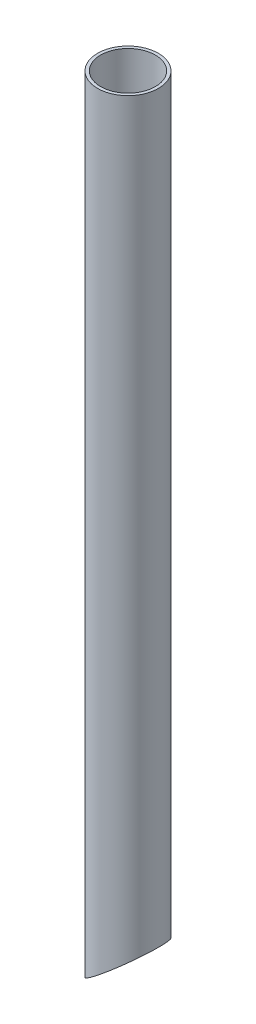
from build123d import *

# Parameters (mm, degrees)
SKIZZE1_R                            = 15
SKIZZE1_R_2                          = 13.5
LINEAR_AUSTRAGEN_D_NN1_DEPTH         = 400
SCHNITT_LINEAR_AUSTRAGEN1_DEPTH      = 401.562105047
SCHNITT_LINEAR_AUSTRAGEN1_DEPTH_BACK = 401.562105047
SCHNITT_LINEAR_AUSTRAGEN2_DEPTH      = 401.562105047
SCHNITT_LINEAR_AUSTRAGEN2_DEPTH_BACK = 401.562105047


with BuildPart() as part:
    # Skizze1 → Linear-Austragen-D_nn1 (new body)
    with BuildSketch(Plane(origin=(0, 0, 0), x_dir=(1, 0, 0), z_dir=(0, 1, 0))):
        Circle(SKIZZE1_R)
        Circle(SKIZZE1_R_2, mode=Mode.SUBTRACT)
    extrude(amount=LINEAR_AUSTRAGEN_D_NN1_DEPTH)

    # Skizze2 → Schnitt-Linear austragen1 (cut, two sides: drawn at the far end of the back side and taken through both)
    with BuildSketch(Plane(origin=(0, 0, 0), x_dir=(0, 0, -1), z_dir=(1, 0, 0)).offset(-SCHNITT_LINEAR_AUSTRAGEN1_DEPTH_BACK)):
        Polygon((-799.570204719, -210.22495276), (-15, 0), (15, 8.038475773), (799.570204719, 218.263428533), (1220.020110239, -1350.876980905), (-379.120299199, -1779.365362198), align=None)
    extrude(amount=SCHNITT_LINEAR_AUSTRAGEN1_DEPTH + SCHNITT_LINEAR_AUSTRAGEN1_DEPTH_BACK, mode=Mode.SUBTRACT)

    # Skizze4 → Schnitt-Linear austragen2 (cut, two sides: drawn at the far end of the back side and taken through both)
    with BuildSketch(Plane.XY.offset(-SCHNITT_LINEAR_AUSTRAGEN2_DEPTH_BACK)):
        Polygon((-19.273927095, 6.141222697), (-20.249031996, -22.261845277), (18.390961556, -23.588393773), (18.390961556, 36.003173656), align=None)
    extrude(amount=SCHNITT_LINEAR_AUSTRAGEN2_DEPTH + SCHNITT_LINEAR_AUSTRAGEN2_DEPTH_BACK, mode=Mode.SUBTRACT)


solid = part.part
